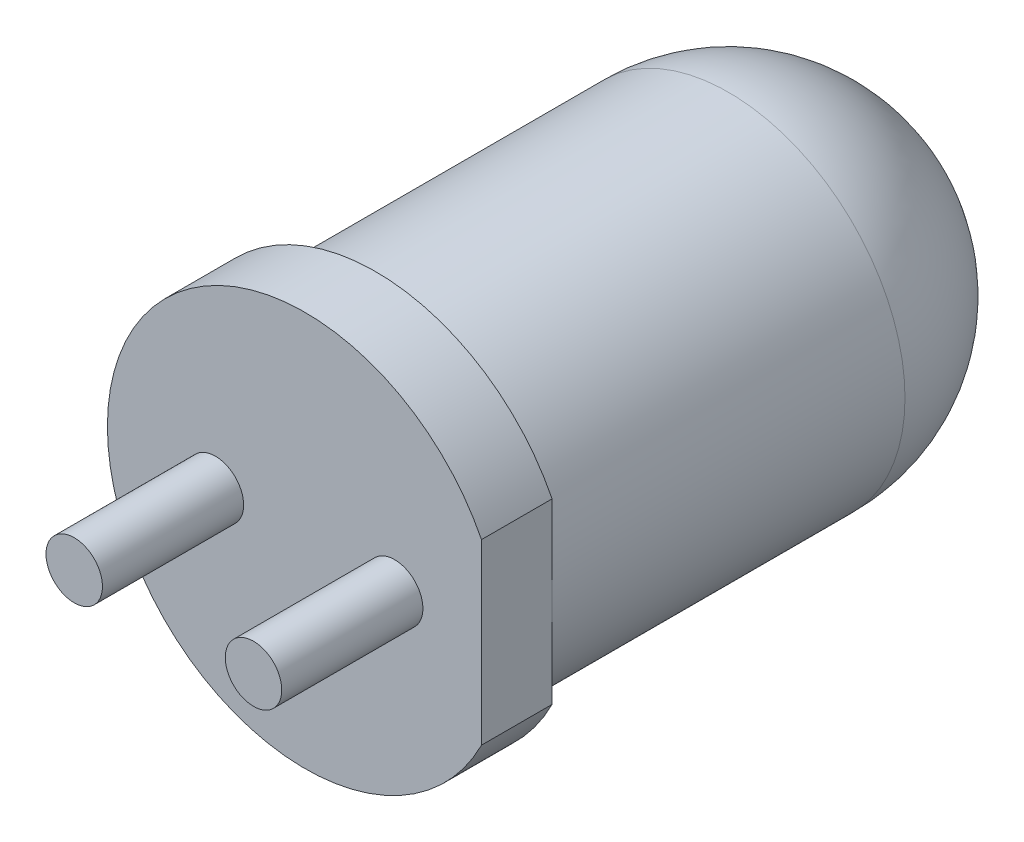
ISO-10303-21;
HEADER;
FILE_DESCRIPTION(('STEP AP214'),'2;1');
FILE_NAME('part.step','',(''),(''),'','','');
FILE_SCHEMA(('AUTOMOTIVE_DESIGN { 1 0 10303 214 1 1 1 1 }'));
ENDSEC;
DATA;
#1=APPLICATION_CONTEXT('core data for automotive mechanical design processes');
#2=APPLICATION_PROTOCOL_DEFINITION('international standard','automotive_design',2000,#1);
#3=PRODUCT_CONTEXT('',#1,'mechanical');
#4=PRODUCT('Part','Part','',(#3));
#5=PRODUCT_RELATED_PRODUCT_CATEGORY('part','',(#4));
#6=PRODUCT_DEFINITION_FORMATION('','',#4);
#7=PRODUCT_DEFINITION_CONTEXT('part definition',#1,'design');
#8=PRODUCT_DEFINITION('design','',#6,#7);
#9=PRODUCT_DEFINITION_SHAPE('','',#8);
#10=(LENGTH_UNIT() NAMED_UNIT(*) SI_UNIT(.MILLI.,.METRE.));
#11=(NAMED_UNIT(*) PLANE_ANGLE_UNIT() SI_UNIT($,.RADIAN.));
#12=(NAMED_UNIT(*) SI_UNIT($,.STERADIAN.) SOLID_ANGLE_UNIT());
#13=UNCERTAINTY_MEASURE_WITH_UNIT(LENGTH_MEASURE(1.E-05),#10,'distance_accuracy_value','');
#14=(GEOMETRIC_REPRESENTATION_CONTEXT(3) GLOBAL_UNCERTAINTY_ASSIGNED_CONTEXT((#13)) GLOBAL_UNIT_ASSIGNED_CONTEXT((#10,
#11,#12)) REPRESENTATION_CONTEXT('',''));
#15=CARTESIAN_POINT('',(0.,0.,0.));
#16=DIRECTION('',(0.,0.,1.));
#17=DIRECTION('',(1.,0.,0.));
#18=AXIS2_PLACEMENT_3D('',#15,#16,#17);
#19=CARTESIAN_POINT('',(0.,0.,8.5));
#20=DIRECTION('',(0.,0.,1.));
#21=DIRECTION('',(1.,0.,0.));
#22=AXIS2_PLACEMENT_3D('',#19,#20,#21);
#23=PLANE('',#22);
#24=CARTESIAN_POINT('',(1.27,0.,8.5));
#25=DIRECTION('',(0.,0.,1.));
#26=DIRECTION('',(1.,0.,0.));
#27=AXIS2_PLACEMENT_3D('',#24,#25,#26);
#28=CIRCLE('',#27,0.4);
#29=CARTESIAN_POINT('',(1.67,0.,8.5));
#30=VERTEX_POINT('',#29);
#31=EDGE_CURVE('E133',#30,#30,#28,.T.);
#32=ORIENTED_EDGE('',*,*,#31,.F.);
#33=EDGE_LOOP('',(#32));
#34=FACE_BOUND('',#33,.T.);
#35=DIRECTION('',(0.,1.,0.));
#36=VECTOR('',#35,1.);
#37=CARTESIAN_POINT('',(2.5,1.26095202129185,8.5));
#38=LINE('',#37,#36);
#39=CARTESIAN_POINT('',(2.5,-1.26095202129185,8.5));
#40=VERTEX_POINT('',#39);
#41=CARTESIAN_POINT('',(2.5,1.26095202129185,8.5));
#42=VERTEX_POINT('',#41);
#43=EDGE_CURVE('E77',#40,#42,#38,.T.);
#44=ORIENTED_EDGE('',*,*,#43,.T.);
#45=CARTESIAN_POINT('',(0.,0.,8.5));
#46=DIRECTION('',(0.,0.,1.));
#47=DIRECTION('',(1.,0.,0.));
#48=AXIS2_PLACEMENT_3D('',#45,#46,#47);
#49=CIRCLE('',#48,2.8);
#50=EDGE_CURVE('E67',#42,#40,#49,.T.);
#51=ORIENTED_EDGE('',*,*,#50,.T.);
#52=EDGE_LOOP('',(#44,#51));
#53=FACE_BOUND('',#52,.T.);
#54=CARTESIAN_POINT('',(-1.27,0.,8.5));
#55=DIRECTION('',(0.,0.,1.));
#56=DIRECTION('',(-1.,0.,0.));
#57=AXIS2_PLACEMENT_3D('',#54,#55,#56);
#58=CIRCLE('',#57,0.4);
#59=CARTESIAN_POINT('',(-1.67,0.,8.5));
#60=VERTEX_POINT('',#59);
#61=EDGE_CURVE('E134',#60,#60,#58,.T.);
#62=ORIENTED_EDGE('',*,*,#61,.F.);
#63=EDGE_LOOP('',(#62));
#64=FACE_BOUND('',#63,.T.);
#65=ADVANCED_FACE('F32',(#34,#53,#64),#23,.T.);
#66=CARTESIAN_POINT('',(0.,0.,8.5));
#67=DIRECTION('',(0.,0.,-1.));
#68=DIRECTION('',(-1.,0.,0.));
#69=AXIS2_PLACEMENT_3D('',#66,#67,#68);
#70=CYLINDRICAL_SURFACE('',#69,2.5);
#71=CARTESIAN_POINT('',(0.,0.,2.5));
#72=DIRECTION('',(0.,0.,-1.));
#73=DIRECTION('',(-1.,0.,0.));
#74=AXIS2_PLACEMENT_3D('',#71,#72,#73);
#75=CIRCLE('',#74,2.5);
#76=CARTESIAN_POINT('',(-2.5,0.,2.5));
#77=VERTEX_POINT('',#76);
#78=EDGE_CURVE('E11',#77,#77,#75,.F.);
#79=ORIENTED_EDGE('',*,*,#78,.T.);
#80=EDGE_LOOP('',(#79));
#81=FACE_BOUND('',#80,.T.);
#82=CARTESIAN_POINT('',(0.,0.,7.5));
#83=DIRECTION('',(0.,0.,1.));
#84=DIRECTION('',(1.,0.,0.));
#85=AXIS2_PLACEMENT_3D('',#82,#83,#84);
#86=CIRCLE('',#85,2.5);
#87=CARTESIAN_POINT('',(2.5,0.,7.5));
#88=VERTEX_POINT('',#87);
#89=EDGE_CURVE('E40',#88,#88,#86,.T.);
#90=ORIENTED_EDGE('',*,*,#89,.F.);
#91=EDGE_LOOP('',(#90));
#92=FACE_BOUND('',#91,.T.);
#93=ADVANCED_FACE('F34',(#81,#92),#70,.T.);
#94=CARTESIAN_POINT('',(0.,0.,7.5));
#95=DIRECTION('',(0.,0.,1.));
#96=DIRECTION('',(1.,0.,0.));
#97=AXIS2_PLACEMENT_3D('',#94,#95,#96);
#98=PLANE('',#97);
#99=DIRECTION('',(0.,1.,0.));
#100=VECTOR('',#99,1.);
#101=CARTESIAN_POINT('',(2.5,1.26095202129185,7.5));
#102=LINE('',#101,#100);
#103=CARTESIAN_POINT('',(2.5,1.26095202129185,7.5));
#104=VERTEX_POINT('',#103);
#105=EDGE_CURVE('E51',#88,#104,#102,.T.);
#106=ORIENTED_EDGE('',*,*,#105,.F.);
#107=ORIENTED_EDGE('',*,*,#89,.T.);
#108=CARTESIAN_POINT('',(2.5,-1.26095202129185,7.5));
#109=VERTEX_POINT('',#108);
#110=EDGE_CURVE('E73',#109,#88,#102,.T.);
#111=ORIENTED_EDGE('',*,*,#110,.F.);
#112=CARTESIAN_POINT('',(0.,0.,7.5));
#113=DIRECTION('',(0.,0.,1.));
#114=DIRECTION('',(1.,0.,0.));
#115=AXIS2_PLACEMENT_3D('',#112,#113,#114);
#116=CIRCLE('',#115,2.8);
#117=EDGE_CURVE('E69',#104,#109,#116,.T.);
#118=ORIENTED_EDGE('',*,*,#117,.F.);
#119=EDGE_LOOP('',(#106,#107,#111,#118));
#120=FACE_BOUND('',#119,.T.);
#121=ADVANCED_FACE('F87',(#120),#98,.F.);
#122=CARTESIAN_POINT('',(2.5,1.26095202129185,7.5));
#123=DIRECTION('',(1.,0.,0.));
#124=DIRECTION('',(0.,0.,-1.));
#125=AXIS2_PLACEMENT_3D('',#122,#123,#124);
#126=PLANE('',#125);
#127=ORIENTED_EDGE('',*,*,#110,.T.);
#128=ORIENTED_EDGE('',*,*,#105,.T.);
#129=DIRECTION('',(0.,0.,1.));
#130=VECTOR('',#129,1.);
#131=CARTESIAN_POINT('',(2.5,1.26095202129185,7.5));
#132=LINE('',#131,#130);
#133=EDGE_CURVE('E72',#104,#42,#132,.T.);
#134=ORIENTED_EDGE('',*,*,#133,.T.);
#135=ORIENTED_EDGE('',*,*,#43,.F.);
#136=DIRECTION('',(0.,0.,1.));
#137=VECTOR('',#136,1.);
#138=CARTESIAN_POINT('',(2.5,-1.26095202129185,7.5));
#139=LINE('',#138,#137);
#140=EDGE_CURVE('E64',#109,#40,#139,.T.);
#141=ORIENTED_EDGE('',*,*,#140,.F.);
#142=EDGE_LOOP('',(#127,#128,#134,#135,#141));
#143=FACE_BOUND('',#142,.T.);
#144=ADVANCED_FACE('F80',(#143),#126,.T.);
#145=CARTESIAN_POINT('',(0.,0.,7.5));
#146=DIRECTION('',(0.,0.,1.));
#147=DIRECTION('',(1.,0.,0.));
#148=AXIS2_PLACEMENT_3D('',#145,#146,#147);
#149=CYLINDRICAL_SURFACE('',#148,2.8);
#150=ORIENTED_EDGE('',*,*,#50,.F.);
#151=ORIENTED_EDGE('',*,*,#133,.F.);
#152=ORIENTED_EDGE('',*,*,#117,.T.);
#153=ORIENTED_EDGE('',*,*,#140,.T.);
#154=EDGE_LOOP('',(#150,#151,#152,#153));
#155=FACE_BOUND('',#154,.T.);
#156=ADVANCED_FACE('F66',(#155),#149,.T.);
#157=CARTESIAN_POINT('',(0.,0.,2.5));
#158=DIRECTION('',(0.,0.,1.));
#159=DIRECTION('',(1.,0.,0.));
#160=AXIS2_PLACEMENT_3D('',#157,#158,#159);
#161=SPHERICAL_SURFACE('',#160,2.5);
#162=ORIENTED_EDGE('',*,*,#78,.F.);
#163=EDGE_LOOP('',(#162));
#164=FACE_BOUND('',#163,.T.);
#165=ADVANCED_FACE('F104',(#164),#161,.T.);
#166=CARTESIAN_POINT('',(1.27,0.,10.5));
#167=DIRECTION('',(0.,0.,-1.));
#168=DIRECTION('',(-1.,0.,0.));
#169=AXIS2_PLACEMENT_3D('',#166,#167,#168);
#170=CYLINDRICAL_SURFACE('',#169,0.4);
#171=CARTESIAN_POINT('',(1.27,0.,10.5));
#172=DIRECTION('',(0.,0.,1.));
#173=DIRECTION('',(1.,0.,0.));
#174=AXIS2_PLACEMENT_3D('',#171,#172,#173);
#175=CIRCLE('',#174,0.4);
#176=CARTESIAN_POINT('',(1.67,0.,10.5));
#177=VERTEX_POINT('',#176);
#178=EDGE_CURVE('E78',#177,#177,#175,.T.);
#179=ORIENTED_EDGE('',*,*,#178,.F.);
#180=EDGE_LOOP('',(#179));
#181=FACE_BOUND('',#180,.T.);
#182=ORIENTED_EDGE('',*,*,#31,.T.);
#183=EDGE_LOOP('',(#182));
#184=FACE_BOUND('',#183,.T.);
#185=ADVANCED_FACE('F108',(#181,#184),#170,.T.);
#186=CARTESIAN_POINT('',(1.27,0.,10.5));
#187=DIRECTION('',(0.,0.,1.));
#188=DIRECTION('',(1.,0.,0.));
#189=AXIS2_PLACEMENT_3D('',#186,#187,#188);
#190=PLANE('',#189);
#191=ORIENTED_EDGE('',*,*,#178,.T.);
#192=EDGE_LOOP('',(#191));
#193=FACE_BOUND('',#192,.T.);
#194=ADVANCED_FACE('F113',(#193),#190,.T.);
#195=CARTESIAN_POINT('',(-1.27,0.,10.5));
#196=DIRECTION('',(0.,0.,-1.));
#197=DIRECTION('',(-1.,0.,0.));
#198=AXIS2_PLACEMENT_3D('',#195,#196,#197);
#199=CYLINDRICAL_SURFACE('',#198,0.4);
#200=CARTESIAN_POINT('',(-1.27,0.,10.5));
#201=DIRECTION('',(0.,0.,1.));
#202=DIRECTION('',(-1.,0.,0.));
#203=AXIS2_PLACEMENT_3D('',#200,#201,#202);
#204=CIRCLE('',#203,0.4);
#205=CARTESIAN_POINT('',(-1.67,0.,10.5));
#206=VERTEX_POINT('',#205);
#207=EDGE_CURVE('E132',#206,#206,#204,.T.);
#208=ORIENTED_EDGE('',*,*,#207,.F.);
#209=EDGE_LOOP('',(#208));
#210=FACE_BOUND('',#209,.T.);
#211=ORIENTED_EDGE('',*,*,#61,.T.);
#212=EDGE_LOOP('',(#211));
#213=FACE_BOUND('',#212,.T.);
#214=ADVANCED_FACE('F120',(#210,#213),#199,.T.);
#215=CARTESIAN_POINT('',(-1.27,0.,10.5));
#216=DIRECTION('',(0.,0.,-1.));
#217=DIRECTION('',(-1.,0.,0.));
#218=AXIS2_PLACEMENT_3D('',#215,#216,#217);
#219=PLANE('',#218);
#220=ORIENTED_EDGE('',*,*,#207,.T.);
#221=EDGE_LOOP('',(#220));
#222=FACE_BOUND('',#221,.T.);
#223=ADVANCED_FACE('F124',(#222),#219,.F.);
#224=CLOSED_SHELL('',(#65,#93,#121,#144,#156,#165,#185,#194,#214,#223));
#225=MANIFOLD_SOLID_BREP('B2',#224);
#226=ADVANCED_BREP_SHAPE_REPRESENTATION('',(#18,#225),#14);
#227=SHAPE_DEFINITION_REPRESENTATION(#9,#226);
ENDSEC;
END-ISO-10303-21;
